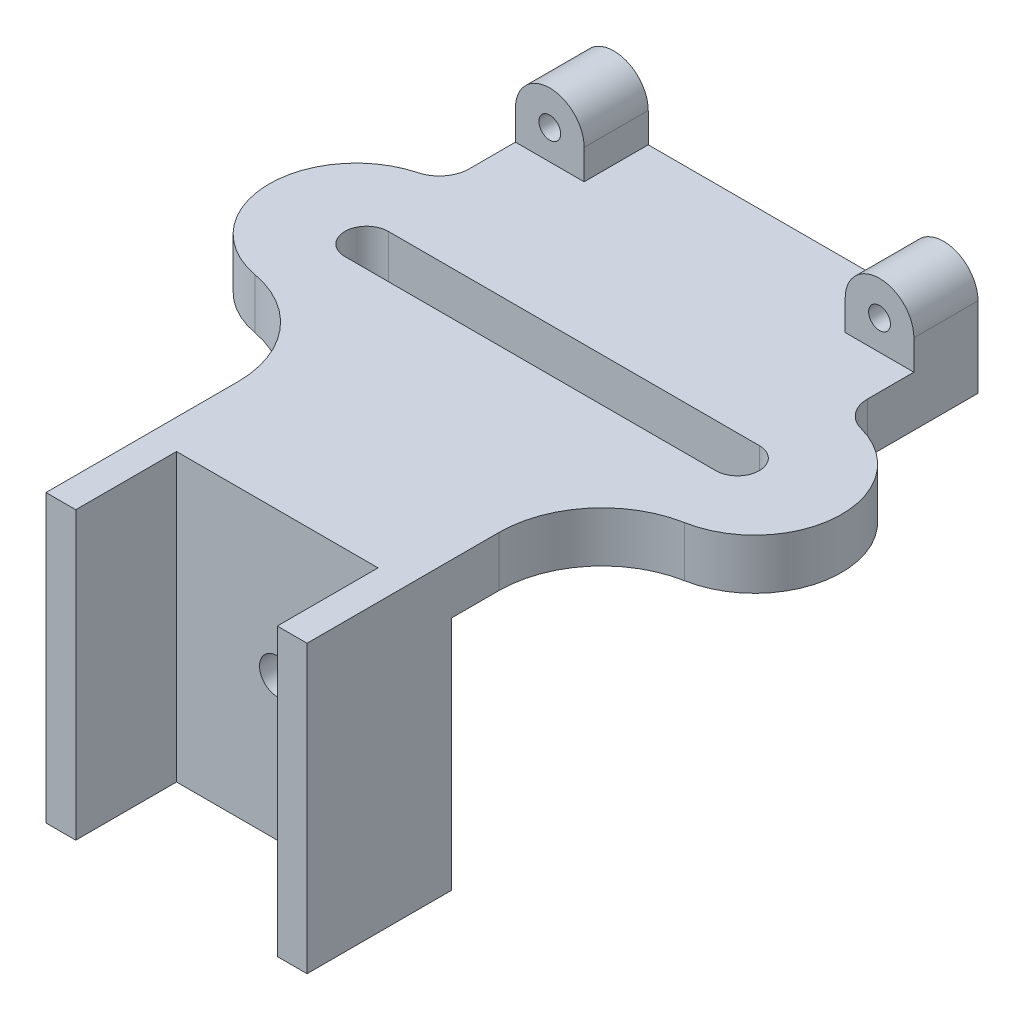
from build123d import *

# Parameters (mm, degrees)
BOSS_EXTRUDE1_DEPTH = 11.176
SKETCH3_R           = 2.413
BOSS_EXTRUDE2_DEPTH = 14.224
BOSS_EXTRUDE3_DEPTH = 52.324
SKETCH5_R           = 3.937
CUT_EXTRUDE1_DEPTH  = 63.5


with BuildPart() as part:
    # Sketch1 → Boss-Extrude1 (new body)
    with BuildSketch(Plane(origin=(0, 0, 0), x_dir=(1, 0, 0), z_dir=(0, 1, 0))):
        with BuildLine():
            Line((-44.196, 0), (44.196, 0))
            Line((44.196, 0), (44.196, -24.506205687))
            ThreePointArc((44.196, -24.506205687), (45.568852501, -28.537075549), (49.116627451, -30.892055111))
            ThreePointArc((49.116627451, -30.892055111), (63.486055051, -50.292), (47.684674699, -68.544525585))
            ThreePointArc((47.684674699, -68.544525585), (34.251523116, -76.397025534), (28.956, -91.028114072))
            Line((28.956, -91.028114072), (28.956, -133.604))
            Line((28.956, -133.604), (22.352, -133.604))
            Line((22.352, -133.604), (22.352, -111.252))
            Line((22.352, -111.252), (-22.352, -111.252))
            Line((-22.352, -111.252), (-22.352, -133.604))
            Line((-22.352, -133.604), (-28.956, -133.604))
            Line((-28.956, -133.604), (-28.956, -91.028114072))
            ThreePointArc((-28.956, -91.028114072), (-34.251523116, -76.397025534), (-47.684674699, -68.544525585))
            ThreePointArc((-47.684674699, -68.544525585), (-63.486055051, -50.292), (-49.116627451, -30.892055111))
            ThreePointArc((-49.116627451, -30.892055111), (-45.568852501, -28.537075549), (-44.196, -24.506205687))
            Line((-44.196, -24.506205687), (-44.196, 0))
        make_face()
        with BuildLine():
            Line((0, -55.118), (41.148, -55.118))
            ThreePointArc((41.148, -55.118), (45.974, -50.292), (41.148, -45.466))
            Line((41.148, -45.466), (0, -45.466))
            Line((0, -45.466), (-41.148, -45.466))
            ThreePointArc((-41.148, -45.466), (-45.974, -50.292), (-41.148, -55.118))
            Line((-41.148, -55.118), (0, -55.118))
        make_face(mode=Mode.SUBTRACT)
    extrude(amount=BOSS_EXTRUDE1_DEPTH)

    # Sketch3 → Boss-Extrude2 (add)
    # profile 1 of 2: a face of its own
    with BuildSketch(Plane(origin=(0, 0, 0), x_dir=(-1, 0, 0), z_dir=(0, 0, -1))):
        with BuildLine():
            Line((-44.196, 17.78), (-44.196, 11.176))
            Line((-44.196, 11.176), (-28.956, 11.176))
            Line((-28.956, 11.176), (-28.956, 17.78))
            ThreePointArc((-28.956, 17.78), (-36.576, 25.4), (-44.196, 17.78))
        make_face()
        with Locations((-36.576, 17.78)):
            Circle(SKETCH3_R, mode=Mode.SUBTRACT)
    # profile 2 of 2: a face of its own
    with BuildSketch(Plane(origin=(0, 0, 0), x_dir=(-1, 0, 0), z_dir=(0, 0, -1))):
        with BuildLine():
            Line((44.196, 17.78), (44.196, 11.176))
            Line((44.196, 11.176), (28.956, 11.176))
            Line((28.956, 11.176), (28.956, 17.78))
            ThreePointArc((28.956, 17.78), (36.576, 25.4), (44.196, 17.78))
        make_face()
        with Locations(Location((36.576, 17.78, 0), (0, 0, 180))):
            Circle(SKETCH3_R, mode=Mode.SUBTRACT)
    extrude(amount=-BOSS_EXTRUDE2_DEPTH)

    # Sketch4 → Boss-Extrude3 (add)
    with BuildSketch(Plane.XZ):
        Polygon((22.352, 133.604), (28.956, 133.604), (28.956, 101.6), (-28.956, 101.6), (-28.956, 133.604), (-22.352, 133.604), (-22.352, 111.252), (22.352, 111.252), align=None)
    extrude(amount=BOSS_EXTRUDE3_DEPTH)

    # Sketch5 → Cut-Extrude1 (cut)
    with BuildSketch(Plane.XY.offset(111.252)):
        with Locations((0, -20.828)):
            Circle(SKETCH5_R)
    extrude(amount=-CUT_EXTRUDE1_DEPTH, mode=Mode.SUBTRACT)


solid = part.part
